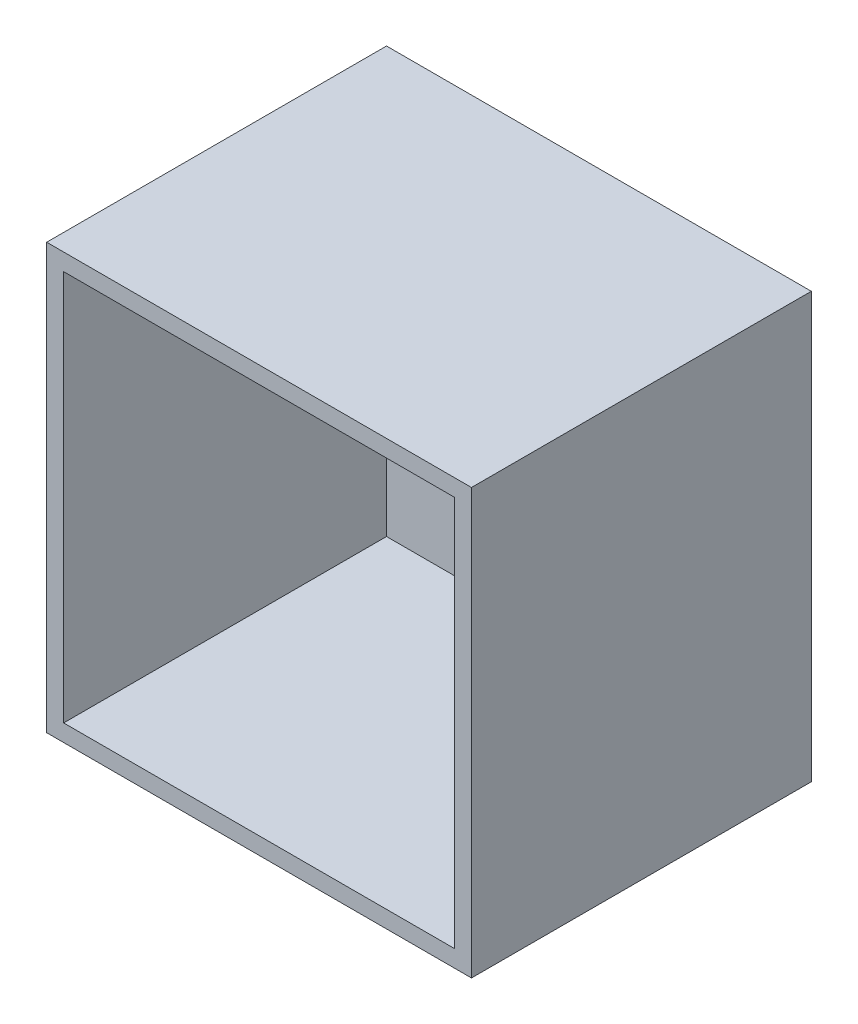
from build123d import *

# Parameters (mm, degrees)
SZKIC1_W                    = 50
SZKIC1_H                    = 50
DODANIE_WYCI_GNI_CIE1_DEPTH = 40
SKORUPA1_T                  = -2


with BuildPart() as part:
    # Szkic1 → Dodanie-wyci_gni_cie1 (new body)
    with BuildSketch(Plane.XY):
        Rectangle(SZKIC1_W, SZKIC1_H)
    extrude(amount=DODANIE_WYCI_GNI_CIE1_DEPTH)

    # Skorupa1
    skorupa1_openings = [part.faces().sort_by_distance(p)[0] for p in [
        (0, 0, 40),
    ]]
    offset(amount=SKORUPA1_T, openings=skorupa1_openings, kind=Kind.INTERSECTION)


solid = part.part
